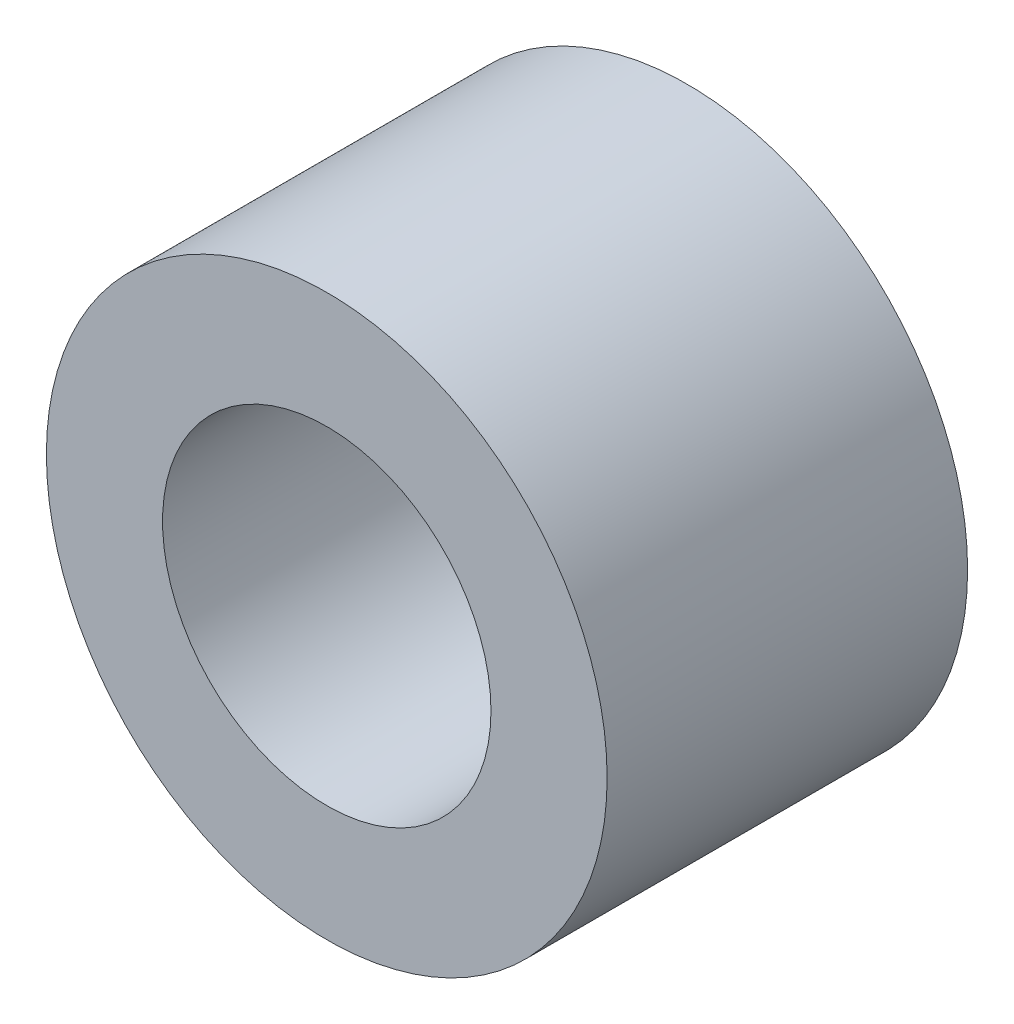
ISO-10303-21;
HEADER;
FILE_DESCRIPTION(('STEP AP214'),'2;1');
FILE_NAME('part.step','',(''),(''),'','','');
FILE_SCHEMA(('AUTOMOTIVE_DESIGN { 1 0 10303 214 1 1 1 1 }'));
ENDSEC;
DATA;
#1=APPLICATION_CONTEXT('core data for automotive mechanical design processes');
#2=APPLICATION_PROTOCOL_DEFINITION('international standard','automotive_design',2000,#1);
#3=PRODUCT_CONTEXT('',#1,'mechanical');
#4=PRODUCT('Part','Part','',(#3));
#5=PRODUCT_RELATED_PRODUCT_CATEGORY('part','',(#4));
#6=PRODUCT_DEFINITION_FORMATION('','',#4);
#7=PRODUCT_DEFINITION_CONTEXT('part definition',#1,'design');
#8=PRODUCT_DEFINITION('design','',#6,#7);
#9=PRODUCT_DEFINITION_SHAPE('','',#8);
#10=(LENGTH_UNIT() NAMED_UNIT(*) SI_UNIT(.MILLI.,.METRE.));
#11=(NAMED_UNIT(*) PLANE_ANGLE_UNIT() SI_UNIT($,.RADIAN.));
#12=(NAMED_UNIT(*) SI_UNIT($,.STERADIAN.) SOLID_ANGLE_UNIT());
#13=UNCERTAINTY_MEASURE_WITH_UNIT(LENGTH_MEASURE(1.E-05),#10,'distance_accuracy_value','');
#14=(GEOMETRIC_REPRESENTATION_CONTEXT(3) GLOBAL_UNCERTAINTY_ASSIGNED_CONTEXT((#13)) GLOBAL_UNIT_ASSIGNED_CONTEXT((#10,
#11,#12)) REPRESENTATION_CONTEXT('',''));
#15=CARTESIAN_POINT('',(0.,0.,0.));
#16=DIRECTION('',(0.,0.,1.));
#17=DIRECTION('',(1.,0.,0.));
#18=AXIS2_PLACEMENT_3D('',#15,#16,#17);
#19=CARTESIAN_POINT('',(138.338098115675,85.5781733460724,0.));
#20=DIRECTION('',(0.,0.,1.));
#21=DIRECTION('',(1.,0.,0.));
#22=AXIS2_PLACEMENT_3D('',#19,#20,#21);
#23=PLANE('',#22);
#24=CARTESIAN_POINT('',(138.338098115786,85.5781733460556,0.));
#25=DIRECTION('',(0.,0.,1.));
#26=DIRECTION('',(1.,0.,0.));
#27=AXIS2_PLACEMENT_3D('',#24,#25,#26);
#28=CIRCLE('',#27,4.10000000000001);
#29=CARTESIAN_POINT('',(142.438098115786,85.5781733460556,0.));
#30=VERTEX_POINT('',#29);
#31=EDGE_CURVE('E10',#30,#30,#28,.T.);
#32=ORIENTED_EDGE('',*,*,#31,.T.);
#33=EDGE_LOOP('',(#32));
#34=FACE_BOUND('',#33,.T.);
#35=CARTESIAN_POINT('',(138.338098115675,85.5781733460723,-2.31065167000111E-12));
#36=DIRECTION('',(0.,0.,1.));
#37=DIRECTION('',(1.,0.,0.));
#38=AXIS2_PLACEMENT_3D('',#35,#36,#37);
#39=CIRCLE('',#38,7.00000000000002);
#40=CARTESIAN_POINT('',(145.338098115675,85.5781733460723,-2.31065167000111E-12));
#41=VERTEX_POINT('',#40);
#42=EDGE_CURVE('E51',#41,#41,#39,.T.);
#43=ORIENTED_EDGE('',*,*,#42,.F.);
#44=EDGE_LOOP('',(#43));
#45=FACE_BOUND('',#44,.T.);
#46=ADVANCED_FACE('F41',(#34,#45),#23,.F.);
#47=CARTESIAN_POINT('',(138.338098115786,85.5781733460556,24.0171943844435));
#48=DIRECTION('',(0.,0.,-1.));
#49=DIRECTION('',(-1.,0.,0.));
#50=AXIS2_PLACEMENT_3D('',#47,#48,#49);
#51=CYLINDRICAL_SURFACE('',#50,4.10000000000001);
#52=ORIENTED_EDGE('',*,*,#31,.F.);
#53=EDGE_LOOP('',(#52));
#54=FACE_BOUND('',#53,.T.);
#55=CARTESIAN_POINT('',(138.338098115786,85.5781733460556,8.99999999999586));
#56=DIRECTION('',(0.,0.,1.));
#57=DIRECTION('',(1.,0.,0.));
#58=AXIS2_PLACEMENT_3D('',#55,#56,#57);
#59=CIRCLE('',#58,4.10000000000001);
#60=CARTESIAN_POINT('',(142.438098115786,85.5781733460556,8.99999999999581));
#61=VERTEX_POINT('',#60);
#62=EDGE_CURVE('E44',#61,#61,#59,.T.);
#63=ORIENTED_EDGE('',*,*,#62,.T.);
#64=EDGE_LOOP('',(#63));
#65=FACE_BOUND('',#64,.T.);
#66=ADVANCED_FACE('F63',(#54,#65),#51,.F.);
#67=CARTESIAN_POINT('',(145.573686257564,84.2536395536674,8.99999999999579));
#68=DIRECTION('',(0.,0.,1.));
#69=DIRECTION('',(-0.822874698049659,-0.568222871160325,0.));
#70=AXIS2_PLACEMENT_3D('',#67,#68,#69);
#71=PLANE('',#70);
#72=ORIENTED_EDGE('',*,*,#62,.F.);
#73=EDGE_LOOP('',(#72));
#74=FACE_BOUND('',#73,.T.);
#75=CARTESIAN_POINT('',(138.338098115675,85.5781733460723,8.99999999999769));
#76=DIRECTION('',(0.,0.,1.));
#77=DIRECTION('',(1.,0.,0.));
#78=AXIS2_PLACEMENT_3D('',#75,#76,#77);
#79=CIRCLE('',#78,7.00000000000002);
#80=CARTESIAN_POINT('',(145.338098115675,85.5781733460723,8.99999999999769));
#81=VERTEX_POINT('',#80);
#82=EDGE_CURVE('E53',#81,#81,#79,.T.);
#83=ORIENTED_EDGE('',*,*,#82,.T.);
#84=EDGE_LOOP('',(#83));
#85=FACE_BOUND('',#84,.T.);
#86=ADVANCED_FACE('F68',(#74,#85),#71,.T.);
#87=CARTESIAN_POINT('',(138.338098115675,85.5781733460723,-2.31065167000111E-12));
#88=DIRECTION('',(0.,0.,1.));
#89=DIRECTION('',(1.,0.,0.));
#90=AXIS2_PLACEMENT_3D('',#87,#88,#89);
#91=CYLINDRICAL_SURFACE('',#90,7.00000000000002);
#92=ORIENTED_EDGE('',*,*,#42,.T.);
#93=EDGE_LOOP('',(#92));
#94=FACE_BOUND('',#93,.T.);
#95=ORIENTED_EDGE('',*,*,#82,.F.);
#96=EDGE_LOOP('',(#95));
#97=FACE_BOUND('',#96,.T.);
#98=ADVANCED_FACE('F59',(#94,#97),#91,.T.);
#99=CLOSED_SHELL('',(#46,#66,#86,#98));
#100=MANIFOLD_SOLID_BREP('B2',#99);
#101=ADVANCED_BREP_SHAPE_REPRESENTATION('',(#18,#100),#14);
#102=SHAPE_DEFINITION_REPRESENTATION(#9,#101);
ENDSEC;
END-ISO-10303-21;
